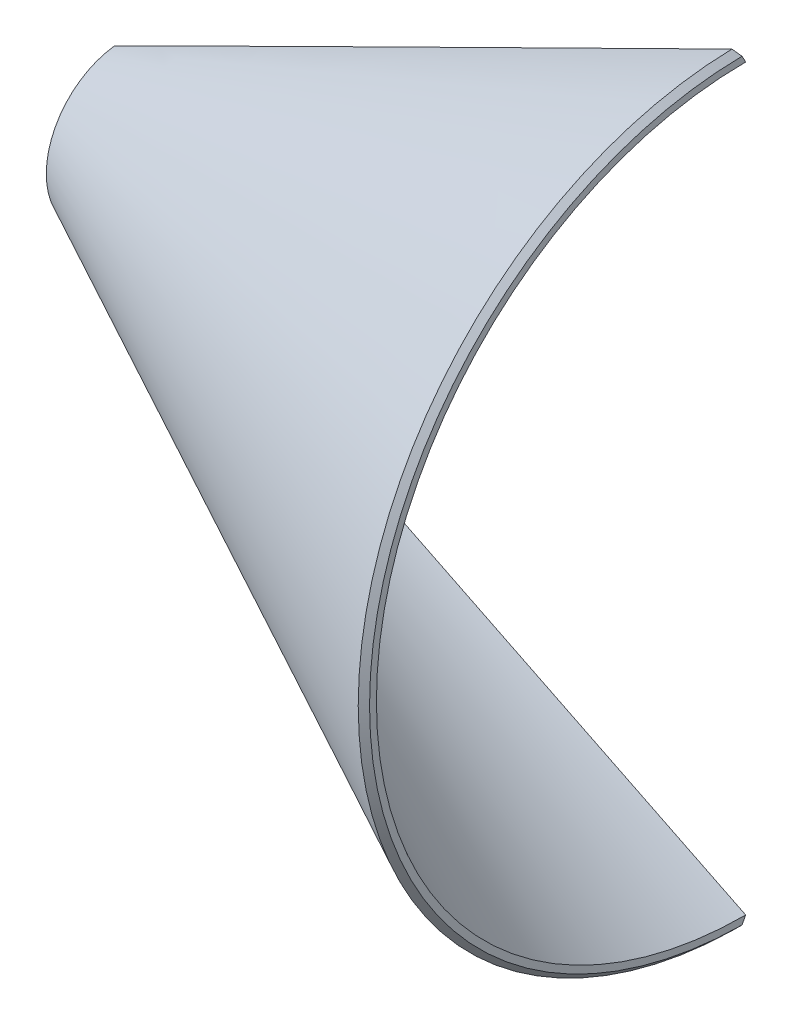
ISO-10303-21;
HEADER;
FILE_DESCRIPTION(('STEP AP214'),'2;1');
FILE_NAME('part.step','',(''),(''),'','','');
FILE_SCHEMA(('AUTOMOTIVE_DESIGN { 1 0 10303 214 1 1 1 1 }'));
ENDSEC;
DATA;
#1=APPLICATION_CONTEXT('core data for automotive mechanical design processes');
#2=APPLICATION_PROTOCOL_DEFINITION('international standard','automotive_design',2000,#1);
#3=PRODUCT_CONTEXT('',#1,'mechanical');
#4=PRODUCT('Part','Part','',(#3));
#5=PRODUCT_RELATED_PRODUCT_CATEGORY('part','',(#4));
#6=PRODUCT_DEFINITION_FORMATION('','',#4);
#7=PRODUCT_DEFINITION_CONTEXT('part definition',#1,'design');
#8=PRODUCT_DEFINITION('design','',#6,#7);
#9=PRODUCT_DEFINITION_SHAPE('','',#8);
#10=(LENGTH_UNIT() NAMED_UNIT(*) SI_UNIT(.MILLI.,.METRE.));
#11=(NAMED_UNIT(*) PLANE_ANGLE_UNIT() SI_UNIT($,.RADIAN.));
#12=(NAMED_UNIT(*) SI_UNIT($,.STERADIAN.) SOLID_ANGLE_UNIT());
#13=UNCERTAINTY_MEASURE_WITH_UNIT(LENGTH_MEASURE(1.E-05),#10,'distance_accuracy_value','');
#14=(GEOMETRIC_REPRESENTATION_CONTEXT(3) GLOBAL_UNCERTAINTY_ASSIGNED_CONTEXT((#13)) GLOBAL_UNIT_ASSIGNED_CONTEXT((#10,
#11,#12)) REPRESENTATION_CONTEXT('',''));
#15=CARTESIAN_POINT('',(0.,0.,0.));
#16=DIRECTION('',(0.,0.,1.));
#17=DIRECTION('',(1.,0.,0.));
#18=AXIS2_PLACEMENT_3D('',#15,#16,#17);
#19=CARTESIAN_POINT('',(-179.311129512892,0.,0.));
#20=DIRECTION('',(1.,0.,0.));
#21=DIRECTION('',(0.,0.,-1.));
#22=AXIS2_PLACEMENT_3D('',#19,#20,#21);
#23=CONICAL_SURFACE('',#22,18.9137774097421,0.458865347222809);
#24=CARTESIAN_POINT('',(0.,0.,0.));
#25=DIRECTION('',(-1.,0.,0.));
#26=DIRECTION('',(0.,0.,1.));
#27=AXIS2_PLACEMENT_3D('',#24,#25,#26);
#28=CIRCLE('',#27,107.5);
#29=CARTESIAN_POINT('',(0.,-107.499999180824,0.0132711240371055));
#30=VERTEX_POINT('',#29);
#31=CARTESIAN_POINT('',(0.,107.499999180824,0.0132711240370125));
#32=VERTEX_POINT('',#31);
#33=EDGE_CURVE('E93',#30,#32,#28,.T.);
#34=ORIENTED_EDGE('',*,*,#33,.F.);
#35=CARTESIAN_POINT('',(-179.311129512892,-18.9135726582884,0.0880068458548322));
#36=CARTESIAN_POINT('',(-177.431242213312,-19.842613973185,0.0828391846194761));
#37=CARTESIAN_POINT('',(-175.551452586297,-20.7718568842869,0.0785656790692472));
#38=CARTESIAN_POINT('',(-171.261795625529,-22.8924728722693,0.070239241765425));
#39=CARTESIAN_POINT('',(-168.851938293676,-24.0838678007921,0.0665883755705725));
#40=CARTESIAN_POINT('',(-163.501791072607,-26.7280728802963,0.0595030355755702));
#41=CARTESIAN_POINT('',(-160.561429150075,-28.1807377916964,0.0562928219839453));
#42=CARTESIAN_POINT('',(-154.150275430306,-31.3474972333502,0.0501988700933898));
#43=CARTESIAN_POINT('',(-150.679438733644,-33.0615011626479,0.0474783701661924));
#44=CARTESIAN_POINT('',(-145.274474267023,-35.7309541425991,0.043732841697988));
#45=CARTESIAN_POINT('',(-143.340290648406,-36.686289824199,0.0424904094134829));
#46=CARTESIAN_POINT('',(-139.339558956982,-38.6628121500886,0.0400760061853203));
#47=CARTESIAN_POINT('',(-137.273023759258,-39.684024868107,0.0389146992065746));
#48=CARTESIAN_POINT('',(-130.675683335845,-42.9439189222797,0.0354707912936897));
#49=CARTESIAN_POINT('',(-126.144740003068,-45.1823210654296,0.0335023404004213));
#50=CARTESIAN_POINT('',(-116.552505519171,-49.9207331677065,0.0298769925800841));
#51=CARTESIAN_POINT('',(-111.491195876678,-52.4207057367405,0.0282835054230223));
#52=CARTESIAN_POINT('',(-100.838426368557,-57.6826600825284,0.0254028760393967));
#53=CARTESIAN_POINT('',(-95.2469726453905,-60.4446543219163,0.0241653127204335));
#54=CARTESIAN_POINT('',(-83.6068839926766,-66.1950135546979,0.0219323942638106));
#55=CARTESIAN_POINT('',(-77.5582665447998,-69.1834139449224,0.0209651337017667));
#56=CARTESIAN_POINT('',(-64.5125416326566,-75.6286093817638,0.019102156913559));
#57=CARTESIAN_POINT('',(-57.5154204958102,-79.0853767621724,0.0182414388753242));
#58=CARTESIAN_POINT('',(-42.5727875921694,-86.4675076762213,0.016607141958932));
#59=CARTESIAN_POINT('',(-34.6272793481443,-90.3928783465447,0.0158611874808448));
#60=CARTESIAN_POINT('',(-17.787853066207,-98.7121771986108,0.0144657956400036));
#61=CARTESIAN_POINT('',(-8.893935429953,-103.106106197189,0.0138385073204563));
#62=CARTESIAN_POINT('',(0.,-107.499999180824,0.0132711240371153));
#63=B_SPLINE_CURVE_WITH_KNOTS('',3,(#35,#36,#37,#38,#39,#40,#41,#42,#43,#44,#45,#46,#47,#48,#49,
#50,#51,#52,#53,#54,#55,#56,#57,#58,#59,#60,#61,#62),.UNSPECIFIED.,.F.,.F.,(4,2,2,2,2,2,2,2,2,2,
2,2,2,4),(0.,6.29079294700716,14.3556313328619,24.1945215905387,35.8074762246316,
42.2792307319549,49.1945036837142,64.3556071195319,81.2907919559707,100.000060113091,
120.239793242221,143.653048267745,170.239825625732,200.000125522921),.UNSPECIFIED.);
#64=CARTESIAN_POINT('',(-179.311129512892,-18.9135726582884,0.0880068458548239));
#65=VERTEX_POINT('',#64);
#66=EDGE_CURVE('E88',#30,#65,#63,.F.);
#67=ORIENTED_EDGE('',*,*,#66,.T.);
#68=CARTESIAN_POINT('',(-179.311129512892,0.,0.));
#69=DIRECTION('',(-1.,0.,0.));
#70=DIRECTION('',(0.,0.,1.));
#71=AXIS2_PLACEMENT_3D('',#68,#69,#70);
#72=CIRCLE('',#71,18.9137774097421);
#73=CARTESIAN_POINT('',(-179.311129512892,18.9135726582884,0.0880068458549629));
#74=VERTEX_POINT('',#73);
#75=EDGE_CURVE('E91',#65,#74,#72,.T.);
#76=ORIENTED_EDGE('',*,*,#75,.T.);
#77=CARTESIAN_POINT('',(0.,107.499999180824,0.0132711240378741));
#78=CARTESIAN_POINT('',(-8.89393545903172,103.106106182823,0.0138385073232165));
#79=CARTESIAN_POINT('',(-17.7878531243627,98.7121771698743,0.0144657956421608));
#80=CARTESIAN_POINT('',(-34.6272794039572,90.3928783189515,0.0158611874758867));
#81=CARTESIAN_POINT('',(-42.5727876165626,86.4675076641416,0.0166071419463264));
#82=CARTESIAN_POINT('',(-57.5154203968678,79.0853768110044,0.0182414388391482));
#83=CARTESIAN_POINT('',(-64.5125414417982,75.628609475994,0.0191021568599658));
#84=CARTESIAN_POINT('',(-77.5582661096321,69.1834141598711,0.0209651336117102));
#85=CARTESIAN_POINT('',(-83.6068834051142,66.1950138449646,0.0219323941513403));
#86=CARTESIAN_POINT('',(-95.2469719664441,60.4446546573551,0.0241653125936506));
#87=CARTESIAN_POINT('',(-100.83842575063,57.6826603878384,0.0254028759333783));
#88=CARTESIAN_POINT('',(-111.491195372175,52.4207059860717,0.0282835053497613));
#89=CARTESIAN_POINT('',(-116.552505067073,49.9207333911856,0.029876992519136));
#90=CARTESIAN_POINT('',(-126.144739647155,45.182321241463,0.0335023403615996));
#91=CARTESIAN_POINT('',(-130.675683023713,42.9439190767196,0.0354707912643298));
#92=CARTESIAN_POINT('',(-137.273023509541,39.6840249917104,0.0389146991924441));
#93=CARTESIAN_POINT('',(-139.339558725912,38.6628122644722,0.0400760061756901));
#94=CARTESIAN_POINT('',(-143.340290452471,36.6862899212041,0.0424904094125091));
#95=CARTESIAN_POINT('',(-145.274474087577,35.7309542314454,0.0437328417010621));
#96=CARTESIAN_POINT('',(-150.679438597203,33.0615012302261,0.0474783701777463));
#97=CARTESIAN_POINT('',(-154.150275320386,31.3474972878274,0.0501988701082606));
#98=CARTESIAN_POINT('',(-160.561429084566,28.1807378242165,0.0562928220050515));
#99=CARTESIAN_POINT('',(-163.501791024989,26.7280729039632,0.0595030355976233));
#100=CARTESIAN_POINT('',(-168.851938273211,24.083867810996,0.0665883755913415));
#101=CARTESIAN_POINT('',(-171.261795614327,22.8924728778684,0.0702392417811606));
#102=CARTESIAN_POINT('',(-175.551452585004,20.7718568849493,0.0785656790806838));
#103=CARTESIAN_POINT('',(-177.431242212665,19.842613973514,0.082839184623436));
#104=CARTESIAN_POINT('',(-179.311129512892,18.9135726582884,0.0880068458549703));
#105=B_SPLINE_CURVE_WITH_KNOTS('',3,(#77,#78,#79,#80,#81,#82,#83,#84,#85,#86,#87,#88,#89,#90,
#91,#92,#93,#94,#95,#96,#97,#98,#99,#100,#101,#102,#103,#104),.UNSPECIFIED.,.F.,.F.,(4,2,2,2,2,
2,2,2,2,2,2,2,2,4),(0.,29.7602999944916,56.3470772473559,79.7603319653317,100.000064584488,
118.709332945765,135.644517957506,150.805621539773,157.720894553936,164.19264911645,
175.805603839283,185.644494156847,193.709332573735,200.000125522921),.UNSPECIFIED.);
#106=EDGE_CURVE('E99',#74,#32,#105,.F.);
#107=ORIENTED_EDGE('',*,*,#106,.T.);
#108=EDGE_LOOP('',(#34,#67,#76,#107));
#109=FACE_BOUND('',#108,.T.);
#110=ADVANCED_FACE('F34',(#109),#23,.F.);
#111=CARTESIAN_POINT('',(-181.082853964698,0.,0.));
#112=DIRECTION('',(-1.,0.,0.));
#113=DIRECTION('',(0.,0.,1.));
#114=AXIS2_PLACEMENT_3D('',#111,#112,#113);
#115=CONICAL_SURFACE('',#114,22.5,1.11193097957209);
#116=ORIENTED_EDGE('',*,*,#75,.F.);
#117=CARTESIAN_POINT('',(-181.082375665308,-22.3303580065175,2.74982647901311));
#118=CARTESIAN_POINT('',(-181.000717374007,-22.1785068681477,2.63055907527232));
#119=CARTESIAN_POINT('',(-180.919318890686,-22.026513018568,2.51129526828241));
#120=CARTESIAN_POINT('',(-180.758702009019,-21.7252698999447,2.27516125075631));
#121=CARTESIAN_POINT('',(-180.679472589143,-21.5760266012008,2.15829091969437));
#122=CARTESIAN_POINT('',(-180.523193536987,-21.2802851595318,1.92694047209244));
#123=CARTESIAN_POINT('',(-180.446132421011,-21.1337931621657,1.81246025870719));
#124=CARTESIAN_POINT('',(-180.294190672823,-20.8435544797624,1.58588679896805));
#125=CARTESIAN_POINT('',(-180.219298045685,-20.6998141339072,1.4737934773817));
#126=CARTESIAN_POINT('',(-180.071693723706,-20.4150789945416,1.25199067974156));
#127=CARTESIAN_POINT('',(-179.998969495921,-20.2740907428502,1.14228114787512));
#128=CARTESIAN_POINT('',(-179.855702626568,-19.9948599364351,0.925242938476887));
#129=CARTESIAN_POINT('',(-179.785146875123,-19.8566241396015,0.817914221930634));
#130=CARTESIAN_POINT('',(-179.646217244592,-19.5828985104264,0.605634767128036));
#131=CARTESIAN_POINT('',(-179.577829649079,-19.4474156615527,0.500684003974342));
#132=CARTESIAN_POINT('',(-179.443238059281,-19.1791956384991,0.293157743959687));
#133=CARTESIAN_POINT('',(-179.377019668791,-19.0464656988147,0.190582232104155));
#134=CARTESIAN_POINT('',(-179.311129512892,-18.9135726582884,0.0880068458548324));
#135=B_SPLINE_CURVE_WITH_KNOTS('',3,(#117,#118,#119,#120,#121,#122,#123,#124,#125,#126,#127,
#128,#129,#130,#131,#132,#133,#134),.UNSPECIFIED.,.F.,.F.,(4,2,2,2,2,2,2,2,4),(0.,
0.628938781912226,1.2452866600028,1.84905410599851,2.44025177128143,3.01889052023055,
3.58498146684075,4.13853601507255,4.67956590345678),.UNSPECIFIED.);
#136=CARTESIAN_POINT('',(-181.082853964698,-22.3313199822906,2.7499359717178));
#137=VERTEX_POINT('',#136);
#138=EDGE_CURVE('E105',#65,#137,#135,.F.);
#139=ORIENTED_EDGE('',*,*,#138,.T.);
#140=CARTESIAN_POINT('',(-181.082853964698,0.,0.));
#141=DIRECTION('',(-1.,0.,0.));
#142=DIRECTION('',(0.,0.,1.));
#143=AXIS2_PLACEMENT_3D('',#140,#141,#142);
#144=CIRCLE('',#143,22.5);
#145=CARTESIAN_POINT('',(-181.082853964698,22.3313188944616,2.74994480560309));
#146=VERTEX_POINT('',#145);
#147=EDGE_CURVE('E109',#137,#146,#144,.T.);
#148=ORIENTED_EDGE('',*,*,#147,.T.);
#149=CARTESIAN_POINT('',(-179.311129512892,18.9135726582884,0.0880068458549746));
#150=CARTESIAN_POINT('',(-179.377019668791,19.0464656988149,0.190582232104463));
#151=CARTESIAN_POINT('',(-179.443238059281,19.1791956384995,0.293157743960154));
#152=CARTESIAN_POINT('',(-179.57782964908,19.4474156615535,0.500684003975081));
#153=CARTESIAN_POINT('',(-179.646217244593,19.5828985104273,0.605634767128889));
#154=CARTESIAN_POINT('',(-179.785146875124,19.8566241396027,0.817914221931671));
#155=CARTESIAN_POINT('',(-179.855702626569,19.9948599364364,0.925242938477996));
#156=CARTESIAN_POINT('',(-179.998969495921,20.2740907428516,1.14228114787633));
#157=CARTESIAN_POINT('',(-180.071693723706,20.415078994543,1.25199067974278));
#158=CARTESIAN_POINT('',(-180.219298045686,20.6998141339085,1.47379347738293));
#159=CARTESIAN_POINT('',(-180.294190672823,20.8435544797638,1.58588679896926));
#160=CARTESIAN_POINT('',(-180.446132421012,21.1337931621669,1.8124602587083));
#161=CARTESIAN_POINT('',(-180.523193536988,21.280285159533,1.92694047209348));
#162=CARTESIAN_POINT('',(-180.679472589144,21.5760266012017,2.15829091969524));
#163=CARTESIAN_POINT('',(-180.758702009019,21.7252698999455,2.27516125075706));
#164=CARTESIAN_POINT('',(-180.919318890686,22.0265130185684,2.51129526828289));
#165=CARTESIAN_POINT('',(-181.000717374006,22.178506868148,2.63055907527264));
#166=CARTESIAN_POINT('',(-181.082375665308,22.3303580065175,2.74982647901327));
#167=B_SPLINE_CURVE_WITH_KNOTS('',3,(#149,#150,#151,#152,#153,#154,#155,#156,#157,#158,#159,
#160,#161,#162,#163,#164,#165,#166),.UNSPECIFIED.,.F.,.F.,(4,2,2,2,2,2,2,2,4),(0.,
0.541029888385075,1.09458443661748,1.66067538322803,2.23931413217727,2.83051179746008,
3.43427924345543,4.05062712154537,4.67956590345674),.UNSPECIFIED.);
#168=EDGE_CURVE('E98',#146,#74,#167,.F.);
#169=ORIENTED_EDGE('',*,*,#168,.T.);
#170=EDGE_LOOP('',(#116,#139,#148,#169));
#171=FACE_BOUND('',#170,.T.);
#172=ADVANCED_FACE('F103',(#171),#115,.F.);
#173=CARTESIAN_POINT('',(-1.64756290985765,0.,0.));
#174=DIRECTION('',(1.,0.,0.));
#175=DIRECTION('',(0.,0.,-1.));
#176=AXIS2_PLACEMENT_3D('',#173,#174,#175);
#177=CONICAL_SURFACE('',#176,111.147562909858,0.458865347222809);
#178=ORIENTED_EDGE('',*,*,#147,.F.);
#179=CARTESIAN_POINT('',(8.61868326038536,-116.195030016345,2.38293200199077));
#180=CARTESIAN_POINT('',(-7.94596674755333,-108.009652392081,2.38829420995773));
#181=CARTESIAN_POINT('',(-24.5104879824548,-99.8239879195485,2.3946633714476));
#182=CARTESIAN_POINT('',(-57.6389173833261,-83.4512294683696,2.4121895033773));
#183=CARTESIAN_POINT('',(-74.2029034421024,-75.2643514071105,2.42274127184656));
#184=CARTESIAN_POINT('',(-107.329217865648,-58.8865002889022,2.45677431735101));
#185=CARTESIAN_POINT('',(-123.892958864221,-50.7006221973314,2.46959531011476));
#186=CARTESIAN_POINT('',(-157.010138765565,-34.2965523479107,2.57406644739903));
#187=CARTESIAN_POINT('',(-173.573171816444,-26.1149469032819,2.59406992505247));
#188=CARTESIAN_POINT('',(-190.100897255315,-17.8130894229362,2.88221331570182));
#189=B_SPLINE_CURVE_WITH_KNOTS('',3,(#179,#180,#181,#182,#183,#184,#185,#186,#187,#188),
.UNSPECIFIED.,.F.,.F.,(4,2,2,2,4),(0.326805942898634,0.382235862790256,0.437665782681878,
0.4930957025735,0.548525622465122),.UNSPECIFIED.);
#190=CARTESIAN_POINT('',(-1.64756290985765,-111.121941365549,2.38639643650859));
#191=VERTEX_POINT('',#190);
#192=EDGE_CURVE('E115',#137,#191,#189,.F.);
#193=ORIENTED_EDGE('',*,*,#192,.T.);
#194=CARTESIAN_POINT('',(-1.64756290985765,0.,0.));
#195=DIRECTION('',(-1.,0.,0.));
#196=DIRECTION('',(0.,0.,1.));
#197=AXIS2_PLACEMENT_3D('',#194,#195,#196);
#198=CIRCLE('',#197,111.147562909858);
#199=CARTESIAN_POINT('',(-1.64756290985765,111.121941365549,2.38639643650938));
#200=VERTEX_POINT('',#199);
#201=EDGE_CURVE('E216',#191,#200,#198,.T.);
#202=ORIENTED_EDGE('',*,*,#201,.T.);
#203=CARTESIAN_POINT('',(-190.100897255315,17.8130894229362,2.88221331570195));
#204=CARTESIAN_POINT('',(-173.573171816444,26.1149469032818,2.59406992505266));
#205=CARTESIAN_POINT('',(-157.010138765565,34.2965523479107,2.57406644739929));
#206=CARTESIAN_POINT('',(-123.892958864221,50.7006221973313,2.46959531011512));
#207=CARTESIAN_POINT('',(-107.329217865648,58.8865002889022,2.45677431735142));
#208=CARTESIAN_POINT('',(-74.2029034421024,75.2643514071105,2.42274127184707));
#209=CARTESIAN_POINT('',(-57.6389173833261,83.4512294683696,2.41218950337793));
#210=CARTESIAN_POINT('',(-24.5104879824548,99.8239879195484,2.39466337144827));
#211=CARTESIAN_POINT('',(-7.94596674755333,108.009652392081,2.38829420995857));
#212=CARTESIAN_POINT('',(8.61868326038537,116.195030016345,2.38293200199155));
#213=B_SPLINE_CURVE_WITH_KNOTS('',3,(#203,#204,#205,#206,#207,#208,#209,#210,#211,#212),
.UNSPECIFIED.,.F.,.F.,(4,2,2,2,4),(0.326805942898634,0.382235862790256,0.437665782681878,
0.4930957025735,0.548525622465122),.UNSPECIFIED.);
#214=EDGE_CURVE('E117',#200,#146,#213,.F.);
#215=ORIENTED_EDGE('',*,*,#214,.T.);
#216=EDGE_LOOP('',(#178,#193,#202,#215));
#217=FACE_BOUND('',#216,.T.);
#218=ADVANCED_FACE('F245',(#217),#177,.T.);
#219=CARTESIAN_POINT('',(0.,0.,0.));
#220=DIRECTION('',(-1.,0.,0.));
#221=DIRECTION('',(0.,0.,1.));
#222=AXIS2_PLACEMENT_3D('',#219,#220,#221);
#223=CONICAL_SURFACE('',#222,109.5,0.785398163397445);
#224=ORIENTED_EDGE('',*,*,#201,.F.);
#225=CARTESIAN_POINT('',(0.,-109.494671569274,1.08023050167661));
#226=CARTESIAN_POINT('',(-0.0686486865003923,-109.562474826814,1.13464879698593));
#227=CARTESIAN_POINT('',(-0.137297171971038,-109.63027787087,1.18906761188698));
#228=CARTESIAN_POINT('',(-0.274594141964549,-109.765883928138,1.29790660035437));
#229=CARTESIAN_POINT('',(-0.34324262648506,-109.833686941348,1.35232677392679));
#230=CARTESIAN_POINT('',(-0.48053959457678,-109.969292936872,1.46116848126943));
#231=CARTESIAN_POINT('',(-0.549188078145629,-110.037095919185,1.51559001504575));
#232=CARTESIAN_POINT('',(-0.686485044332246,-110.172701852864,1.62443444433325));
#233=CARTESIAN_POINT('',(-0.755133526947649,-110.240504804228,1.67885733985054));
#234=CARTESIAN_POINT('',(-0.892430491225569,-110.376110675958,1.78770449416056));
#235=CARTESIAN_POINT('',(-0.961078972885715,-110.443913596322,1.84212875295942));
#236=CARTESIAN_POINT('',(-1.09837593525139,-110.579519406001,1.95097863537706));
#237=CARTESIAN_POINT('',(-1.16702441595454,-110.647322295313,2.00540425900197));
#238=CARTESIAN_POINT('',(-1.30432137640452,-110.782928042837,2.11425687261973));
#239=CARTESIAN_POINT('',(-1.37296985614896,-110.850730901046,2.16868386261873));
#240=CARTESIAN_POINT('',(-1.51026681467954,-110.98633658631,2.27753921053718));
#241=CARTESIAN_POINT('',(-1.5789152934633,-111.054139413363,2.33196756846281));
#242=CARTESIAN_POINT('',(-1.64756356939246,-111.121942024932,2.38639645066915));
#243=B_SPLINE_CURVE_WITH_KNOTS('',3,(#225,#226,#227,#228,#229,#230,#231,#232,#233,#234,#235,
#236,#237,#238,#239,#240,#241,#242),.UNSPECIFIED.,.F.,.F.,(4,2,2,2,2,2,2,2,4),(0.,
0.332327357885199,0.664656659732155,0.996987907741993,1.32932110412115,1.66165625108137,
1.99399335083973,2.32633240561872,2.65867341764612),.UNSPECIFIED.);
#244=CARTESIAN_POINT('',(0.,-109.494671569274,1.08023050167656));
#245=VERTEX_POINT('',#244);
#246=EDGE_CURVE('E61',#191,#245,#243,.F.);
#247=ORIENTED_EDGE('',*,*,#246,.T.);
#248=CARTESIAN_POINT('',(0.,0.,0.));
#249=DIRECTION('',(-1.,0.,0.));
#250=DIRECTION('',(0.,0.,1.));
#251=AXIS2_PLACEMENT_3D('',#248,#249,#250);
#252=CIRCLE('',#251,109.5);
#253=CARTESIAN_POINT('',(0.,109.494671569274,1.08023050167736));
#254=VERTEX_POINT('',#253);
#255=EDGE_CURVE('E215',#245,#254,#252,.T.);
#256=ORIENTED_EDGE('',*,*,#255,.T.);
#257=CARTESIAN_POINT('',(-1.64756356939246,111.121942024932,2.38639645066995));
#258=CARTESIAN_POINT('',(-1.5789152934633,111.054139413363,2.33196756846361));
#259=CARTESIAN_POINT('',(-1.51026681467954,110.98633658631,2.27753921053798));
#260=CARTESIAN_POINT('',(-1.37296985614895,110.850730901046,2.16868386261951));
#261=CARTESIAN_POINT('',(-1.30432137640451,110.782928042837,2.11425687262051));
#262=CARTESIAN_POINT('',(-1.16702441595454,110.647322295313,2.00540425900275));
#263=CARTESIAN_POINT('',(-1.09837593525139,110.579519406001,1.95097863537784));
#264=CARTESIAN_POINT('',(-0.96107897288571,110.443913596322,1.8421287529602));
#265=CARTESIAN_POINT('',(-0.89243049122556,110.376110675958,1.78770449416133));
#266=CARTESIAN_POINT('',(-0.755133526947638,110.240504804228,1.6788573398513));
#267=CARTESIAN_POINT('',(-0.686485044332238,110.172701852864,1.62443444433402));
#268=CARTESIAN_POINT('',(-0.549188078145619,110.037095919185,1.51559001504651));
#269=CARTESIAN_POINT('',(-0.480539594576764,109.969292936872,1.46116848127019));
#270=CARTESIAN_POINT('',(-0.343242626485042,109.833686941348,1.35232677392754));
#271=CARTESIAN_POINT('',(-0.274594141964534,109.765883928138,1.29790660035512));
#272=CARTESIAN_POINT('',(-0.137297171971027,109.63027787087,1.18906761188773));
#273=CARTESIAN_POINT('',(-0.0686486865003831,109.562474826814,1.13464879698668));
#274=CARTESIAN_POINT('',(0.,109.494671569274,1.08023050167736));
#275=B_SPLINE_CURVE_WITH_KNOTS('',3,(#257,#258,#259,#260,#261,#262,#263,#264,#265,#266,#267,
#268,#269,#270,#271,#272,#273,#274),.UNSPECIFIED.,.F.,.F.,(4,2,2,2,2,2,2,2,4),(0.,
0.332341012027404,0.664680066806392,0.997017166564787,1.329352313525,1.66168550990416,
1.99401675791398,2.32634605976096,2.65867341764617),.UNSPECIFIED.);
#276=EDGE_CURVE('E196',#254,#200,#275,.F.);
#277=ORIENTED_EDGE('',*,*,#276,.T.);
#278=EDGE_LOOP('',(#224,#247,#256,#277));
#279=FACE_BOUND('',#278,.T.);
#280=ADVANCED_FACE('F237',(#279),#223,.T.);
#281=CARTESIAN_POINT('',(0.,-107.5,-7.50668487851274E-13));
#282=DIRECTION('',(-1.,0.,0.));
#283=DIRECTION('',(0.,0.,1.));
#284=AXIS2_PLACEMENT_3D('',#281,#282,#283);
#285=PLANE('',#284);
#286=ORIENTED_EDGE('',*,*,#255,.F.);
#287=CARTESIAN_POINT('',(0.,-107.499999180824,0.0132711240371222));
#288=CARTESIAN_POINT('',(-5.24049195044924E-09,-107.583110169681,0.0577328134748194));
#289=CARTESIAN_POINT('',(-9.82222063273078E-09,-107.666221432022,0.102193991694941));
#290=CARTESIAN_POINT('',(-1.76708600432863E-08,-107.832443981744,0.191115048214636));
#291=CARTESIAN_POINT('',(-2.09377790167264E-08,-107.915555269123,0.235574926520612));
#292=CARTESIAN_POINT('',(-2.61595892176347E-08,-108.081777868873,0.32449338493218));
#293=CARTESIAN_POINT('',(-2.81144886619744E-08,-108.164889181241,0.368951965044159));
#294=CARTESIAN_POINT('',(-3.07150892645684E-08,-108.331111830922,0.457867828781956));
#295=CARTESIAN_POINT('',(-3.13607986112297E-08,-108.414223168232,0.502325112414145));
#296=CARTESIAN_POINT('',(-3.13457882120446E-08,-108.580445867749,0.591238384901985));
#297=CARTESIAN_POINT('',(-3.06850766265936E-08,-108.663557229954,0.635694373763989));
#298=CARTESIAN_POINT('',(-2.80601071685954E-08,-108.829779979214,0.724605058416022));
#299=CARTESIAN_POINT('',(-2.60958574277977E-08,-108.912891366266,0.769059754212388));
#300=CARTESIAN_POINT('',(-2.08665856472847E-08,-109.079114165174,0.857967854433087));
#301=CARTESIAN_POINT('',(-1.76015717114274E-08,-109.162225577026,0.902421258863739));
#302=CARTESIAN_POINT('',(-9.77357314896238E-09,-109.32844842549,0.991326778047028));
#303=CARTESIAN_POINT('',(-5.21059659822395E-09,-109.411559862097,1.03577889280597));
#304=CARTESIAN_POINT('',(0.,-109.494671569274,1.08023050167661));
#305=B_SPLINE_CURVE_WITH_KNOTS('',3,(#287,#288,#289,#290,#291,#292,#293,#294,#295,#296,#297,
#298,#299,#300,#301,#302,#303,#304),.UNSPECIFIED.,.F.,.F.,(4,2,2,2,2,2,2,2,4),(0.,
0.282769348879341,0.565536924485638,0.848302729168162,1.13106676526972,1.41382903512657,
1.69658954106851,1.97934828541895,2.26210527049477),.UNSPECIFIED.);
#306=EDGE_CURVE('E12',#245,#30,#305,.F.);
#307=ORIENTED_EDGE('',*,*,#306,.T.);
#308=ORIENTED_EDGE('',*,*,#33,.T.);
#309=CARTESIAN_POINT('',(0.,109.494671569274,1.08023050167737));
#310=CARTESIAN_POINT('',(-5.21057013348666E-09,109.411559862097,1.03577889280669));
#311=CARTESIAN_POINT('',(-9.77353928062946E-09,109.32844842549,0.991326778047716));
#312=CARTESIAN_POINT('',(-1.76015389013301E-08,109.162225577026,0.902421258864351));
#313=CARTESIAN_POINT('',(-2.08665612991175E-08,109.079114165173,0.857967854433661));
#314=CARTESIAN_POINT('',(-2.60958549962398E-08,108.912891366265,0.769059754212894));
#315=CARTESIAN_POINT('',(-2.80601181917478E-08,108.829779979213,0.724605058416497));
#316=CARTESIAN_POINT('',(-3.06850791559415E-08,108.663557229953,0.635694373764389));
#317=CARTESIAN_POINT('',(-3.13457687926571E-08,108.580445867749,0.591238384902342));
#318=CARTESIAN_POINT('',(-3.13607710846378E-08,108.414223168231,0.502325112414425));
#319=CARTESIAN_POINT('',(-3.07150755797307E-08,108.331111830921,0.457867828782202));
#320=CARTESIAN_POINT('',(-2.8114493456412E-08,108.16488918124,0.368951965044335));
#321=CARTESIAN_POINT('',(-2.61595986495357E-08,108.081777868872,0.324493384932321));
#322=CARTESIAN_POINT('',(-2.09378037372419E-08,107.915555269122,0.235574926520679));
#323=CARTESIAN_POINT('',(-1.76708954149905E-08,107.832443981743,0.191115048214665));
#324=CARTESIAN_POINT('',(-9.82226115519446E-09,107.66622143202,0.102193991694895));
#325=CARTESIAN_POINT('',(-5.24052697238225E-09,107.583110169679,0.0577328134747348));
#326=CARTESIAN_POINT('',(0.,107.499999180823,0.0132711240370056));
#327=B_SPLINE_CURVE_WITH_KNOTS('',3,(#309,#310,#311,#312,#313,#314,#315,#316,#317,#318,#319,
#320,#321,#322,#323,#324,#325,#326),.UNSPECIFIED.,.F.,.F.,(4,2,2,2,2,2,2,2,4),(0.,
0.282756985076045,0.565515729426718,0.848276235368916,1.13103850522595,1.41380254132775,
1.69656834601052,1.97933592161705,2.26210527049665),.UNSPECIFIED.);
#328=EDGE_CURVE('E47',#32,#254,#327,.F.);
#329=ORIENTED_EDGE('',*,*,#328,.T.);
#330=EDGE_LOOP('',(#286,#307,#308,#329));
#331=FACE_BOUND('',#330,.T.);
#332=ADVANCED_FACE('F137',(#331),#285,.F.);
#333=CARTESIAN_POINT('',(10.3904077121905,-112.609561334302,-7.86697096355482E-13));
#334=CARTESIAN_POINT('',(-6.17424229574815,-104.42429439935,-7.28914882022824E-13));
#335=CARTESIAN_POINT('',(-22.7387635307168,-96.2387667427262,-6.72311478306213E-13));
#336=CARTESIAN_POINT('',(-55.8671929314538,-79.8664710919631,-5.57607466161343E-13));
#337=CARTESIAN_POINT('',(-72.4311789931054,-71.6798605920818,-5.01075314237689E-13));
#338=CARTESIAN_POINT('',(-105.557493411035,-55.3032858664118,-3.86235743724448E-13));
#339=CARTESIAN_POINT('',(-122.121236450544,-47.1161548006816,-3.29292788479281E-13));
#340=CARTESIAN_POINT('',(-155.238412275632,-30.7211688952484,-2.14543021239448E-13));
#341=CARTESIAN_POINT('',(-171.801447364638,-22.5324631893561,-1.57425833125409E-13));
#342=CARTESIAN_POINT('',(-188.329172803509,-14.272908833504,0.));
#343=CARTESIAN_POINT('',(8.61868326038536,-116.195030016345,2.38293200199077));
#344=CARTESIAN_POINT('',(-7.94596674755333,-108.009652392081,2.38829420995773));
#345=CARTESIAN_POINT('',(-24.5104879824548,-99.8239879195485,2.3946633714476));
#346=CARTESIAN_POINT('',(-57.6389173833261,-83.4512294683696,2.4121895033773));
#347=CARTESIAN_POINT('',(-74.2029034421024,-75.2643514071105,2.42274127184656));
#348=CARTESIAN_POINT('',(-107.329217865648,-58.8865002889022,2.45677431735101));
#349=CARTESIAN_POINT('',(-123.892958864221,-50.7006221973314,2.46959531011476));
#350=CARTESIAN_POINT('',(-157.010138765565,-34.2965523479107,2.57406644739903));
#351=CARTESIAN_POINT('',(-173.573171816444,-26.1149469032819,2.59406992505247));
#352=CARTESIAN_POINT('',(-190.100897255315,-17.8130894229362,2.88221331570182));
#353=B_SPLINE_SURFACE_WITH_KNOTS('',1,3,((#333,#334,#335,#336,#337,#338,#339,#340,#341,#342),
(#343,#344,#345,#346,#347,#348,#349,#350,#351,#352)),.UNSPECIFIED.,.F.,.F.,.F.,(2,2),(4,2,2,2,
4),(0.,1.),(0.326805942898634,0.382235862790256,0.437665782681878,0.4930957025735,
0.548525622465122),.UNSPECIFIED.);
#354=ORIENTED_EDGE('',*,*,#246,.F.);
#355=ORIENTED_EDGE('',*,*,#192,.F.);
#356=ORIENTED_EDGE('',*,*,#138,.F.);
#357=ORIENTED_EDGE('',*,*,#66,.F.);
#358=ORIENTED_EDGE('',*,*,#306,.F.);
#359=EDGE_LOOP('',(#354,#355,#356,#357,#358));
#360=FACE_BOUND('',#359,.T.);
#361=ADVANCED_FACE('F113',(#360),#353,.T.);
#362=CARTESIAN_POINT('',(8.61868326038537,116.195030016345,2.38293200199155));
#363=CARTESIAN_POINT('',(-7.94596674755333,108.009652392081,2.38829420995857));
#364=CARTESIAN_POINT('',(-24.5104879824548,99.8239879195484,2.39466337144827));
#365=CARTESIAN_POINT('',(-57.6389173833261,83.4512294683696,2.41218950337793));
#366=CARTESIAN_POINT('',(-74.2029034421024,75.2643514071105,2.42274127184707));
#367=CARTESIAN_POINT('',(-107.329217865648,58.8865002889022,2.45677431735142));
#368=CARTESIAN_POINT('',(-123.892958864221,50.7006221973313,2.46959531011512));
#369=CARTESIAN_POINT('',(-157.010138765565,34.2965523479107,2.57406644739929));
#370=CARTESIAN_POINT('',(-173.573171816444,26.1149469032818,2.59406992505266));
#371=CARTESIAN_POINT('',(-190.100897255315,17.8130894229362,2.88221331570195));
#372=CARTESIAN_POINT('',(10.3904077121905,112.609561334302,0.));
#373=CARTESIAN_POINT('',(-6.17424229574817,104.42429439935,0.));
#374=CARTESIAN_POINT('',(-22.7387635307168,96.2387667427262,0.));
#375=CARTESIAN_POINT('',(-55.8671929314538,79.8664710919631,0.));
#376=CARTESIAN_POINT('',(-72.4311789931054,71.6798605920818,0.));
#377=CARTESIAN_POINT('',(-105.557493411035,55.3032858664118,0.));
#378=CARTESIAN_POINT('',(-122.121236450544,47.1161548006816,0.));
#379=CARTESIAN_POINT('',(-155.238412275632,30.7211688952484,0.));
#380=CARTESIAN_POINT('',(-171.801447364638,22.5324631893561,0.));
#381=CARTESIAN_POINT('',(-188.329172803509,14.272908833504,0.));
#382=B_SPLINE_SURFACE_WITH_KNOTS('',1,3,((#362,#363,#364,#365,#366,#367,#368,#369,#370,#371),
(#372,#373,#374,#375,#376,#377,#378,#379,#380,#381)),.UNSPECIFIED.,.F.,.F.,.F.,(2,2),(4,2,2,2,
4),(0.,1.),(0.326805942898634,0.382235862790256,0.437665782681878,0.4930957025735,
0.548525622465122),.UNSPECIFIED.);
#383=ORIENTED_EDGE('',*,*,#328,.F.);
#384=ORIENTED_EDGE('',*,*,#106,.F.);
#385=ORIENTED_EDGE('',*,*,#168,.F.);
#386=ORIENTED_EDGE('',*,*,#214,.F.);
#387=ORIENTED_EDGE('',*,*,#276,.F.);
#388=EDGE_LOOP('',(#383,#384,#385,#386,#387));
#389=FACE_BOUND('',#388,.T.);
#390=ADVANCED_FACE('F36',(#389),#382,.T.);
#391=CLOSED_SHELL('',(#110,#172,#218,#280,#332,#361,#390));
#392=MANIFOLD_SOLID_BREP('B2',#391);
#393=ADVANCED_BREP_SHAPE_REPRESENTATION('',(#18,#392),#14);
#394=SHAPE_DEFINITION_REPRESENTATION(#9,#393);
ENDSEC;
END-ISO-10303-21;
